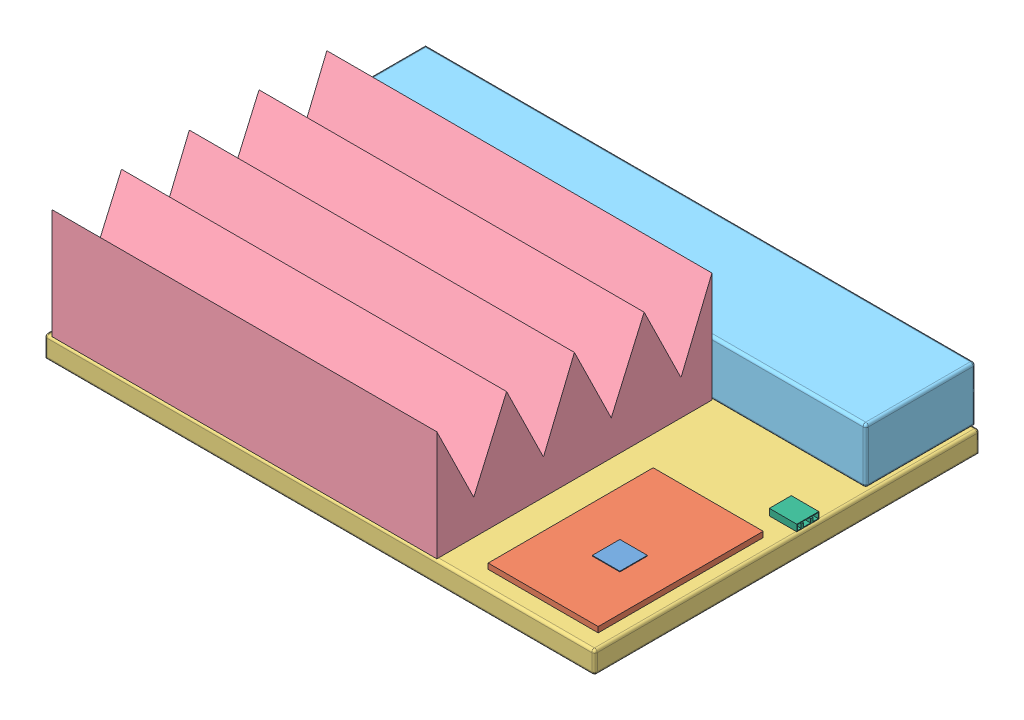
SolidWorks assembly Cooling Module.SLDASM, configuration Default (file format 9000). Lengths in mm.
Overall size (100.89 24 70.18).
6 component instances, 6 part files, 7 mates.
Components (placement in the parent):
- nrf module-1: nrf module.SLDPRT [Default] at (72.5376 54.2857 120.5812) size (5 0.12 5)
- pcb_peltier-1: pcb_peltier.SLDPRT [Default] at (64.1624 53.2857 106.1455) size (20 1 30)
- Peltier module-1: Peltier module.SLDPRT [Default] at (-13.3125 49.2857 69.335) size (100 4 70)
- heat sink-1: heat sink.SLDPRT [Default] at (-12.1523 53.2857 89.1506) size (70 20 50)
- Li-ion battery-2: Li-ion battery.SLDPRT [Default] at (-14.2028 53.2857 69.1506) size (100 10 20)
- usb-1: usb.SLDPRT [Default] at (81.3042 54.4857 102.1789) x (0 0 -1) z (0 -1 0) size (4 5 1.2)
Mates (geometry in assembly coordinates):
- Distance1: distance anti-aligned: plane of Peltier module-1 through (-13.3125 53.2857 69.335) normal (0 1 0); plane of heat sink-1 through (-12.1523 53.2857 89.1506) normal (0 -1 0)
- Distance3: distance anti-aligned: plane of nrf module-1 through (72.5376 54.2857 120.5812) normal (0 -1 0); plane of pcb_peltier-1 through (64.1624 54.2857 106.1455) normal (0 1 0)
- Distance4: distance anti-aligned: plane of pcb_peltier-1 through (64.1624 53.2857 106.1455) normal (0 -1 0); plane of Peltier module-1 through (-13.3125 53.2857 69.335) normal (0 1 0)
- Distance5: distance anti-aligned: plane of heat sink-1 through (-12.1523 73.2857 89.1506) normal (0 0 -1); plane of Li-ion battery-2 through (-14.2028 63.2857 89.1506) normal (0 0 1)
- Distance6: distance anti-aligned: plane of Peltier module-1 through (-13.3125 53.2857 69.335) normal (0 1 0); plane of Li-ion battery-2 through (-14.2028 53.2857 69.1506) normal (0 -1 0)
- Distance7: distance anti-aligned: plane of Peltier module-1 through (-13.3125 53.2857 69.335) normal (0 1 0); plane of usb-1 through (86.3042 53.2857 102.1789) normal (0 -1 0)
- Perpendicular1: perpendicular: plane of Peltier module-1 through (86.6875 53.2857 69.335) normal (1 0 0); plane of usb-1 through (86.3042 54.4857 98.1789) normal (0 0 -1)
